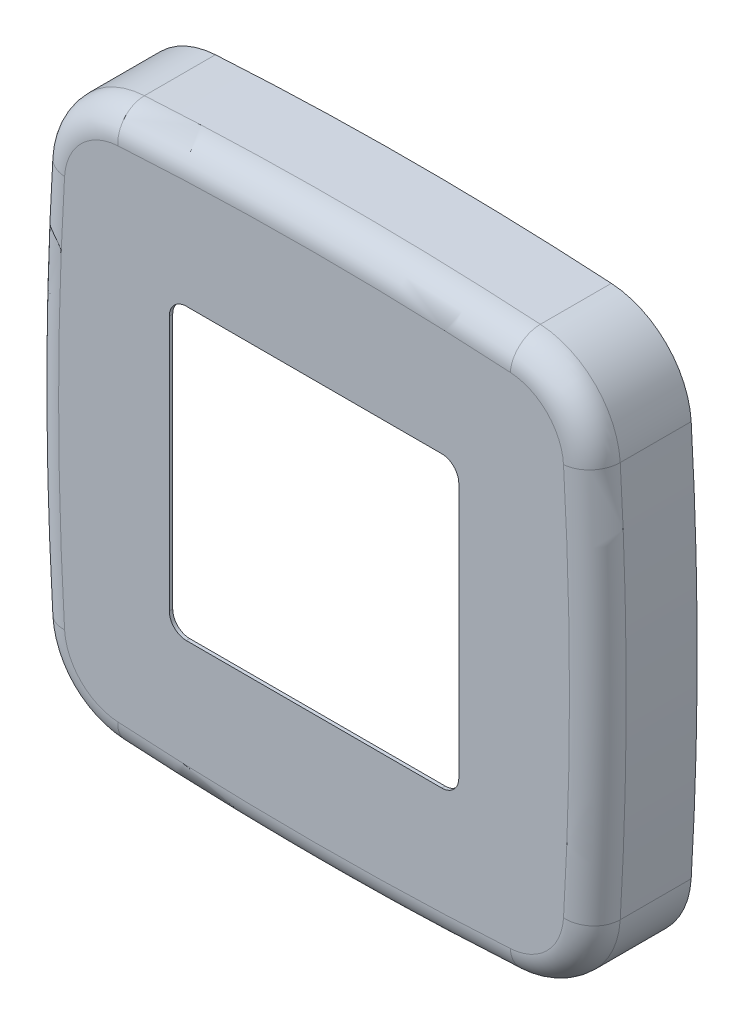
ISO-10303-21;
HEADER;
FILE_DESCRIPTION(('STEP AP214'),'2;1');
FILE_NAME('part.step','',(''),(''),'','','');
FILE_SCHEMA(('AUTOMOTIVE_DESIGN { 1 0 10303 214 1 1 1 1 }'));
ENDSEC;
DATA;
#1=APPLICATION_CONTEXT('core data for automotive mechanical design processes');
#2=APPLICATION_PROTOCOL_DEFINITION('international standard','automotive_design',2000,#1);
#3=PRODUCT_CONTEXT('',#1,'mechanical');
#4=PRODUCT('Part','Part','',(#3));
#5=PRODUCT_RELATED_PRODUCT_CATEGORY('part','',(#4));
#6=PRODUCT_DEFINITION_FORMATION('','',#4);
#7=PRODUCT_DEFINITION_CONTEXT('part definition',#1,'design');
#8=PRODUCT_DEFINITION('design','',#6,#7);
#9=PRODUCT_DEFINITION_SHAPE('','',#8);
#10=(LENGTH_UNIT() NAMED_UNIT(*) SI_UNIT(.MILLI.,.METRE.));
#11=(NAMED_UNIT(*) PLANE_ANGLE_UNIT() SI_UNIT($,.RADIAN.));
#12=(NAMED_UNIT(*) SI_UNIT($,.STERADIAN.) SOLID_ANGLE_UNIT());
#13=UNCERTAINTY_MEASURE_WITH_UNIT(LENGTH_MEASURE(1.E-05),#10,'distance_accuracy_value','');
#14=(GEOMETRIC_REPRESENTATION_CONTEXT(3) GLOBAL_UNCERTAINTY_ASSIGNED_CONTEXT((#13)) GLOBAL_UNIT_ASSIGNED_CONTEXT((#10,
#11,#12)) REPRESENTATION_CONTEXT('',''));
#15=CARTESIAN_POINT('',(0.,0.,0.));
#16=DIRECTION('',(0.,0.,1.));
#17=DIRECTION('',(1.,0.,0.));
#18=AXIS2_PLACEMENT_3D('',#15,#16,#17);
#19=CARTESIAN_POINT('',(25.5,-25.5,-133.75));
#20=DIRECTION('',(0.,1.,0.));
#21=DIRECTION('',(-1.,0.,0.));
#22=AXIS2_PLACEMENT_3D('',#19,#20,#21);
#23=PLANE('',#22);
#24=DIRECTION('',(0.,0.,1.));
#25=VECTOR('',#24,1.);
#26=CARTESIAN_POINT('',(22.5,-25.5,-8.75));
#27=LINE('',#26,#25);
#28=CARTESIAN_POINT('',(22.5,-25.5,8.75));
#29=VERTEX_POINT('',#28);
#30=CARTESIAN_POINT('',(22.5,-25.5,8.15));
#31=VERTEX_POINT('',#30);
#32=EDGE_CURVE('E479',#29,#31,#27,.F.);
#33=ORIENTED_EDGE('',*,*,#32,.T.);
#34=DIRECTION('',(-1.,0.,0.));
#35=VECTOR('',#34,1.);
#36=CARTESIAN_POINT('',(0.,-25.5,8.15));
#37=LINE('',#36,#35);
#38=CARTESIAN_POINT('',(-22.5,-25.5,8.15));
#39=VERTEX_POINT('',#38);
#40=EDGE_CURVE('E327',#31,#39,#37,.T.);
#41=ORIENTED_EDGE('',*,*,#40,.T.);
#42=DIRECTION('',(0.,0.,1.));
#43=VECTOR('',#42,1.);
#44=CARTESIAN_POINT('',(-22.5,-25.5,8.75));
#45=LINE('',#44,#43);
#46=CARTESIAN_POINT('',(-22.5,-25.5,8.75));
#47=VERTEX_POINT('',#46);
#48=EDGE_CURVE('E484',#39,#47,#45,.T.);
#49=ORIENTED_EDGE('',*,*,#48,.T.);
#50=DIRECTION('',(-1.,0.,0.));
#51=VECTOR('',#50,1.);
#52=CARTESIAN_POINT('',(25.5,-25.5,8.75));
#53=LINE('',#52,#51);
#54=EDGE_CURVE('E346',#29,#47,#53,.T.);
#55=ORIENTED_EDGE('',*,*,#54,.F.);
#56=EDGE_LOOP('',(#33,#41,#49,#55));
#57=FACE_BOUND('',#56,.T.);
#58=ADVANCED_FACE('F15',(#57),#23,.T.);
#59=CARTESIAN_POINT('',(-25.5,-25.5,-133.75));
#60=DIRECTION('',(1.,0.,0.));
#61=DIRECTION('',(0.,0.,-1.));
#62=AXIS2_PLACEMENT_3D('',#59,#60,#61);
#63=PLANE('',#62);
#64=DIRECTION('',(0.,0.,1.));
#65=VECTOR('',#64,1.);
#66=CARTESIAN_POINT('',(-25.5,-22.5,-8.75));
#67=LINE('',#66,#65);
#68=CARTESIAN_POINT('',(-25.5,-22.5,8.75));
#69=VERTEX_POINT('',#68);
#70=CARTESIAN_POINT('',(-25.5,-22.5,8.15));
#71=VERTEX_POINT('',#70);
#72=EDGE_CURVE('E486',#69,#71,#67,.F.);
#73=ORIENTED_EDGE('',*,*,#72,.T.);
#74=DIRECTION('',(0.,1.,0.));
#75=VECTOR('',#74,1.);
#76=CARTESIAN_POINT('',(-25.5,0.,8.15));
#77=LINE('',#76,#75);
#78=CARTESIAN_POINT('',(-25.5,22.5,8.15));
#79=VERTEX_POINT('',#78);
#80=EDGE_CURVE('E323',#71,#79,#77,.T.);
#81=ORIENTED_EDGE('',*,*,#80,.T.);
#82=DIRECTION('',(0.,0.,1.));
#83=VECTOR('',#82,1.);
#84=CARTESIAN_POINT('',(-25.5,22.5,8.75));
#85=LINE('',#84,#83);
#86=CARTESIAN_POINT('',(-25.5,22.5,8.75));
#87=VERTEX_POINT('',#86);
#88=EDGE_CURVE('E491',#79,#87,#85,.T.);
#89=ORIENTED_EDGE('',*,*,#88,.T.);
#90=DIRECTION('',(0.,1.,0.));
#91=VECTOR('',#90,1.);
#92=CARTESIAN_POINT('',(-25.5,-25.5,8.75));
#93=LINE('',#92,#91);
#94=EDGE_CURVE('E359',#69,#87,#93,.T.);
#95=ORIENTED_EDGE('',*,*,#94,.F.);
#96=EDGE_LOOP('',(#73,#81,#89,#95));
#97=FACE_BOUND('',#96,.T.);
#98=ADVANCED_FACE('F502',(#97),#63,.T.);
#99=CARTESIAN_POINT('',(-25.5,25.5,-133.75));
#100=DIRECTION('',(0.,-1.,0.));
#101=DIRECTION('',(0.,0.,-1.));
#102=AXIS2_PLACEMENT_3D('',#99,#100,#101);
#103=PLANE('',#102);
#104=DIRECTION('',(0.,0.,1.));
#105=VECTOR('',#104,1.);
#106=CARTESIAN_POINT('',(-22.5,25.5,-8.75));
#107=LINE('',#106,#105);
#108=CARTESIAN_POINT('',(-22.5,25.5,8.75));
#109=VERTEX_POINT('',#108);
#110=CARTESIAN_POINT('',(-22.5,25.5,8.15));
#111=VERTEX_POINT('',#110);
#112=EDGE_CURVE('E23',#109,#111,#107,.F.);
#113=ORIENTED_EDGE('',*,*,#112,.T.);
#114=DIRECTION('',(1.,0.,0.));
#115=VECTOR('',#114,1.);
#116=CARTESIAN_POINT('',(0.,25.5,8.15));
#117=LINE('',#116,#115);
#118=CARTESIAN_POINT('',(22.5,25.5,8.15));
#119=VERTEX_POINT('',#118);
#120=EDGE_CURVE('E38',#111,#119,#117,.T.);
#121=ORIENTED_EDGE('',*,*,#120,.T.);
#122=DIRECTION('',(0.,0.,1.));
#123=VECTOR('',#122,1.);
#124=CARTESIAN_POINT('',(22.5,25.5,8.75));
#125=LINE('',#124,#123);
#126=CARTESIAN_POINT('',(22.5,25.5,8.75));
#127=VERTEX_POINT('',#126);
#128=EDGE_CURVE('E450',#119,#127,#125,.T.);
#129=ORIENTED_EDGE('',*,*,#128,.T.);
#130=DIRECTION('',(1.,0.,0.));
#131=VECTOR('',#130,1.);
#132=CARTESIAN_POINT('',(-25.5,25.5,8.75));
#133=LINE('',#132,#131);
#134=EDGE_CURVE('E363',#109,#127,#133,.T.);
#135=ORIENTED_EDGE('',*,*,#134,.F.);
#136=EDGE_LOOP('',(#113,#121,#129,#135));
#137=FACE_BOUND('',#136,.T.);
#138=ADVANCED_FACE('F496',(#137),#103,.T.);
#139=CARTESIAN_POINT('',(25.5,25.5,-133.75));
#140=DIRECTION('',(-1.,0.,0.));
#141=DIRECTION('',(0.,0.,1.));
#142=AXIS2_PLACEMENT_3D('',#139,#140,#141);
#143=PLANE('',#142);
#144=DIRECTION('',(0.,0.,1.));
#145=VECTOR('',#144,1.);
#146=CARTESIAN_POINT('',(25.5,22.5,-8.75));
#147=LINE('',#146,#145);
#148=CARTESIAN_POINT('',(25.5,22.5,8.75));
#149=VERTEX_POINT('',#148);
#150=CARTESIAN_POINT('',(25.5,22.5,8.15));
#151=VERTEX_POINT('',#150);
#152=EDGE_CURVE('E472',#149,#151,#147,.F.);
#153=ORIENTED_EDGE('',*,*,#152,.T.);
#154=DIRECTION('',(0.,-1.,0.));
#155=VECTOR('',#154,1.);
#156=CARTESIAN_POINT('',(25.5,0.,8.15));
#157=LINE('',#156,#155);
#158=CARTESIAN_POINT('',(25.5,-22.5,8.15));
#159=VERTEX_POINT('',#158);
#160=EDGE_CURVE('E318',#151,#159,#157,.T.);
#161=ORIENTED_EDGE('',*,*,#160,.T.);
#162=DIRECTION('',(0.,0.,1.));
#163=VECTOR('',#162,1.);
#164=CARTESIAN_POINT('',(25.5,-22.5,8.75));
#165=LINE('',#164,#163);
#166=CARTESIAN_POINT('',(25.5,-22.5,8.75));
#167=VERTEX_POINT('',#166);
#168=EDGE_CURVE('E477',#159,#167,#165,.T.);
#169=ORIENTED_EDGE('',*,*,#168,.T.);
#170=DIRECTION('',(0.,-1.,0.));
#171=VECTOR('',#170,1.);
#172=CARTESIAN_POINT('',(25.5,25.5,8.75));
#173=LINE('',#172,#171);
#174=EDGE_CURVE('E367',#149,#167,#173,.T.);
#175=ORIENTED_EDGE('',*,*,#174,.F.);
#176=EDGE_LOOP('',(#153,#161,#169,#175));
#177=FACE_BOUND('',#176,.T.);
#178=ADVANCED_FACE('F517',(#177),#143,.T.);
#179=CARTESIAN_POINT('',(0.,0.,8.75));
#180=DIRECTION('',(0.,0.,1.));
#181=DIRECTION('',(1.,0.,0.));
#182=AXIS2_PLACEMENT_3D('',#179,#180,#181);
#183=PLANE('',#182);
#184=CARTESIAN_POINT('',(-33.9722676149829,-33.972267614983,8.75));
#185=DIRECTION('',(0.,0.,1.));
#186=DIRECTION('',(1.,0.,0.));
#187=AXIS2_PLACEMENT_3D('',#184,#185,#186);
#188=CIRCLE('',#187,10.);
#189=CARTESIAN_POINT('',(-43.9539805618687,-34.5767563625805,8.75));
#190=VERTEX_POINT('',#189);
#191=CARTESIAN_POINT('',(-34.5767563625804,-43.9539805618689,8.75));
#192=VERTEX_POINT('',#191);
#193=EDGE_CURVE('E428',#190,#192,#188,.T.);
#194=ORIENTED_EDGE('',*,*,#193,.T.);
#195=CARTESIAN_POINT('',(0.,527.,8.75));
#196=DIRECTION('',(0.,0.,1.));
#197=DIRECTION('',(1.,0.,0.));
#198=AXIS2_PLACEMENT_3D('',#195,#196,#197);
#199=CIRCLE('',#198,572.);
#200=CARTESIAN_POINT('',(34.5767563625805,-43.9539805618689,8.75));
#201=VERTEX_POINT('',#200);
#202=EDGE_CURVE('E430',#192,#201,#199,.T.);
#203=ORIENTED_EDGE('',*,*,#202,.T.);
#204=CARTESIAN_POINT('',(33.972267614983,-33.972267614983,8.75));
#205=DIRECTION('',(0.,0.,1.));
#206=DIRECTION('',(1.,0.,0.));
#207=AXIS2_PLACEMENT_3D('',#204,#205,#206);
#208=CIRCLE('',#207,10.);
#209=CARTESIAN_POINT('',(43.9539805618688,-34.5767563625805,8.75));
#210=VERTEX_POINT('',#209);
#211=EDGE_CURVE('E426',#201,#210,#208,.T.);
#212=ORIENTED_EDGE('',*,*,#211,.T.);
#213=CARTESIAN_POINT('',(-527.,0.,8.75));
#214=DIRECTION('',(0.,0.,1.));
#215=DIRECTION('',(1.,0.,0.));
#216=AXIS2_PLACEMENT_3D('',#213,#214,#215);
#217=CIRCLE('',#216,572.);
#218=CARTESIAN_POINT('',(43.9539805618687,34.5767563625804,8.75));
#219=VERTEX_POINT('',#218);
#220=EDGE_CURVE('E422',#210,#219,#217,.T.);
#221=ORIENTED_EDGE('',*,*,#220,.T.);
#222=CARTESIAN_POINT('',(33.9722676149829,33.9722676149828,8.75));
#223=DIRECTION('',(0.,0.,1.));
#224=DIRECTION('',(1.,0.,0.));
#225=AXIS2_PLACEMENT_3D('',#222,#223,#224);
#226=CIRCLE('',#225,10.);
#227=CARTESIAN_POINT('',(34.5767563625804,43.9539805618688,8.75));
#228=VERTEX_POINT('',#227);
#229=EDGE_CURVE('E418',#219,#228,#226,.T.);
#230=ORIENTED_EDGE('',*,*,#229,.T.);
#231=CARTESIAN_POINT('',(0.,-527.,8.75));
#232=DIRECTION('',(0.,0.,1.));
#233=DIRECTION('',(1.,0.,0.));
#234=AXIS2_PLACEMENT_3D('',#231,#232,#233);
#235=CIRCLE('',#234,572.);
#236=CARTESIAN_POINT('',(-34.5767563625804,43.9539805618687,8.75));
#237=VERTEX_POINT('',#236);
#238=EDGE_CURVE('E416',#228,#237,#235,.T.);
#239=ORIENTED_EDGE('',*,*,#238,.T.);
#240=CARTESIAN_POINT('',(-33.9722676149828,33.9722676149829,8.75));
#241=DIRECTION('',(0.,0.,1.));
#242=DIRECTION('',(1.,0.,0.));
#243=AXIS2_PLACEMENT_3D('',#240,#241,#242);
#244=CIRCLE('',#243,10.);
#245=CARTESIAN_POINT('',(-43.9539805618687,34.5767563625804,8.75));
#246=VERTEX_POINT('',#245);
#247=EDGE_CURVE('E420',#237,#246,#244,.T.);
#248=ORIENTED_EDGE('',*,*,#247,.T.);
#249=CARTESIAN_POINT('',(527.,0.,8.75));
#250=DIRECTION('',(0.,0.,1.));
#251=DIRECTION('',(1.,0.,0.));
#252=AXIS2_PLACEMENT_3D('',#249,#250,#251);
#253=CIRCLE('',#252,572.);
#254=EDGE_CURVE('E424',#246,#190,#253,.T.);
#255=ORIENTED_EDGE('',*,*,#254,.T.);
#256=EDGE_LOOP('',(#194,#203,#212,#221,#230,#239,#248,#255));
#257=FACE_BOUND('',#256,.T.);
#258=ORIENTED_EDGE('',*,*,#94,.T.);
#259=CARTESIAN_POINT('',(-22.5,22.5,8.75));
#260=DIRECTION('',(0.,0.,1.));
#261=DIRECTION('',(1.,0.,0.));
#262=AXIS2_PLACEMENT_3D('',#259,#260,#261);
#263=CIRCLE('',#262,3.);
#264=EDGE_CURVE('E10',#87,#109,#263,.F.);
#265=ORIENTED_EDGE('',*,*,#264,.T.);
#266=ORIENTED_EDGE('',*,*,#134,.T.);
#267=CARTESIAN_POINT('',(22.5,22.5,8.75));
#268=DIRECTION('',(0.,0.,1.));
#269=DIRECTION('',(1.,0.,0.));
#270=AXIS2_PLACEMENT_3D('',#267,#268,#269);
#271=CIRCLE('',#270,3.);
#272=EDGE_CURVE('E475',#127,#149,#271,.F.);
#273=ORIENTED_EDGE('',*,*,#272,.T.);
#274=ORIENTED_EDGE('',*,*,#174,.T.);
#275=CARTESIAN_POINT('',(22.5,-22.5,8.75));
#276=DIRECTION('',(0.,0.,1.));
#277=DIRECTION('',(1.,0.,0.));
#278=AXIS2_PLACEMENT_3D('',#275,#276,#277);
#279=CIRCLE('',#278,3.);
#280=EDGE_CURVE('E482',#167,#29,#279,.F.);
#281=ORIENTED_EDGE('',*,*,#280,.T.);
#282=ORIENTED_EDGE('',*,*,#54,.T.);
#283=CARTESIAN_POINT('',(-22.5,-22.5,8.75));
#284=DIRECTION('',(0.,0.,1.));
#285=DIRECTION('',(1.,0.,0.));
#286=AXIS2_PLACEMENT_3D('',#283,#284,#285);
#287=CIRCLE('',#286,3.);
#288=EDGE_CURVE('E489',#47,#69,#287,.F.);
#289=ORIENTED_EDGE('',*,*,#288,.T.);
#290=EDGE_LOOP('',(#258,#265,#266,#273,#274,#281,#282,#289));
#291=FACE_BOUND('',#290,.T.);
#292=ADVANCED_FACE('F524',(#257,#291),#183,.T.);
#293=CARTESIAN_POINT('',(0.,0.,-8.75));
#294=DIRECTION('',(0.,0.,1.));
#295=DIRECTION('',(1.,0.,0.));
#296=AXIS2_PLACEMENT_3D('',#293,#294,#295);
#297=PLANE('',#296);
#298=CARTESIAN_POINT('',(-33.9722676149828,33.9722676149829,-8.75));
#299=DIRECTION('',(0.,0.,1.));
#300=DIRECTION('',(1.,0.,0.));
#301=AXIS2_PLACEMENT_3D('',#298,#299,#300);
#302=CIRCLE('',#301,14.4);
#303=CARTESIAN_POINT('',(-48.3459342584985,34.8427314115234,-8.75));
#304=VERTEX_POINT('',#303);
#305=CARTESIAN_POINT('',(-34.8427314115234,48.3459342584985,-8.75));
#306=VERTEX_POINT('',#305);
#307=EDGE_CURVE('E264',#304,#306,#302,.F.);
#308=ORIENTED_EDGE('',*,*,#307,.F.);
#309=CARTESIAN_POINT('',(527.,0.,-8.75));
#310=DIRECTION('',(0.,0.,1.));
#311=DIRECTION('',(1.,0.,0.));
#312=AXIS2_PLACEMENT_3D('',#309,#310,#311);
#313=CIRCLE('',#312,576.4);
#314=CARTESIAN_POINT('',(-48.3459342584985,-34.8427314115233,-8.75));
#315=VERTEX_POINT('',#314);
#316=EDGE_CURVE('E292',#304,#315,#313,.T.);
#317=ORIENTED_EDGE('',*,*,#316,.T.);
#318=CARTESIAN_POINT('',(-33.9722676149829,-33.972267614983,-8.75));
#319=DIRECTION('',(0.,0.,1.));
#320=DIRECTION('',(1.,0.,0.));
#321=AXIS2_PLACEMENT_3D('',#318,#319,#320);
#322=CIRCLE('',#321,14.4);
#323=CARTESIAN_POINT('',(-34.8427314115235,-48.3459342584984,-8.75));
#324=VERTEX_POINT('',#323);
#325=EDGE_CURVE('E283',#324,#315,#322,.F.);
#326=ORIENTED_EDGE('',*,*,#325,.F.);
#327=CARTESIAN_POINT('',(0.,527.,-8.75));
#328=DIRECTION('',(0.,0.,1.));
#329=DIRECTION('',(1.,0.,0.));
#330=AXIS2_PLACEMENT_3D('',#327,#328,#329);
#331=CIRCLE('',#330,576.4);
#332=CARTESIAN_POINT('',(34.8427314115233,-48.3459342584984,-8.75));
#333=VERTEX_POINT('',#332);
#334=EDGE_CURVE('E30',#324,#333,#331,.T.);
#335=ORIENTED_EDGE('',*,*,#334,.T.);
#336=CARTESIAN_POINT('',(33.972267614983,-33.972267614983,-8.75));
#337=DIRECTION('',(0.,0.,1.));
#338=DIRECTION('',(1.,0.,0.));
#339=AXIS2_PLACEMENT_3D('',#336,#337,#338);
#340=CIRCLE('',#339,14.4);
#341=CARTESIAN_POINT('',(48.3459342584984,-34.8427314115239,-8.75));
#342=VERTEX_POINT('',#341);
#343=EDGE_CURVE('E298',#342,#333,#340,.F.);
#344=ORIENTED_EDGE('',*,*,#343,.F.);
#345=CARTESIAN_POINT('',(-527.,0.,-8.75));
#346=DIRECTION('',(0.,0.,1.));
#347=DIRECTION('',(1.,0.,0.));
#348=AXIS2_PLACEMENT_3D('',#345,#346,#347);
#349=CIRCLE('',#348,576.4);
#350=CARTESIAN_POINT('',(48.3459342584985,34.8427314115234,-8.75));
#351=VERTEX_POINT('',#350);
#352=EDGE_CURVE('E278',#342,#351,#349,.T.);
#353=ORIENTED_EDGE('',*,*,#352,.T.);
#354=CARTESIAN_POINT('',(33.9722676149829,33.9722676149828,-8.75));
#355=DIRECTION('',(0.,0.,1.));
#356=DIRECTION('',(1.,0.,0.));
#357=AXIS2_PLACEMENT_3D('',#354,#355,#356);
#358=CIRCLE('',#357,14.4);
#359=CARTESIAN_POINT('',(34.8427314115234,48.3459342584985,-8.75));
#360=VERTEX_POINT('',#359);
#361=EDGE_CURVE('E286',#360,#351,#358,.F.);
#362=ORIENTED_EDGE('',*,*,#361,.F.);
#363=CARTESIAN_POINT('',(0.,-527.,-8.75));
#364=DIRECTION('',(0.,0.,1.));
#365=DIRECTION('',(1.,0.,0.));
#366=AXIS2_PLACEMENT_3D('',#363,#364,#365);
#367=CIRCLE('',#366,576.4);
#368=EDGE_CURVE('E347',#360,#306,#367,.T.);
#369=ORIENTED_EDGE('',*,*,#368,.T.);
#370=EDGE_LOOP('',(#308,#317,#326,#335,#344,#353,#362,#369));
#371=FACE_BOUND('',#370,.T.);
#372=CARTESIAN_POINT('',(527.,0.,-8.75));
#373=DIRECTION('',(0.,0.,1.));
#374=DIRECTION('',(1.,0.,0.));
#375=AXIS2_PLACEMENT_3D('',#372,#373,#374);
#376=CIRCLE('',#375,577.);
#377=CARTESIAN_POINT('',(-48.9448370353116,34.8790007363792,-8.75));
#378=VERTEX_POINT('',#377);
#379=CARTESIAN_POINT('',(-48.9448370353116,-34.8790007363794,-8.75));
#380=VERTEX_POINT('',#379);
#381=EDGE_CURVE('E383',#378,#380,#376,.T.);
#382=ORIENTED_EDGE('',*,*,#381,.F.);
#383=CARTESIAN_POINT('',(-33.9722676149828,33.9722676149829,-8.75));
#384=DIRECTION('',(0.,0.,1.));
#385=DIRECTION('',(1.,0.,0.));
#386=AXIS2_PLACEMENT_3D('',#383,#384,#385);
#387=CIRCLE('',#386,15.);
#388=CARTESIAN_POINT('',(-34.8790007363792,48.9448370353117,-8.75));
#389=VERTEX_POINT('',#388);
#390=EDGE_CURVE('E414',#378,#389,#387,.F.);
#391=ORIENTED_EDGE('',*,*,#390,.T.);
#392=CARTESIAN_POINT('',(0.,-527.,-8.75));
#393=DIRECTION('',(0.,0.,1.));
#394=DIRECTION('',(1.,0.,0.));
#395=AXIS2_PLACEMENT_3D('',#392,#393,#394);
#396=CIRCLE('',#395,577.);
#397=CARTESIAN_POINT('',(34.8790007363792,48.9448370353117,-8.75));
#398=VERTEX_POINT('',#397);
#399=EDGE_CURVE('E377',#398,#389,#396,.T.);
#400=ORIENTED_EDGE('',*,*,#399,.F.);
#401=CARTESIAN_POINT('',(33.9722676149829,33.9722676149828,-8.75));
#402=DIRECTION('',(0.,0.,1.));
#403=DIRECTION('',(1.,0.,0.));
#404=AXIS2_PLACEMENT_3D('',#401,#402,#403);
#405=CIRCLE('',#404,15.);
#406=CARTESIAN_POINT('',(48.9448370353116,34.8790007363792,-8.75));
#407=VERTEX_POINT('',#406);
#408=EDGE_CURVE('E390',#398,#407,#405,.F.);
#409=ORIENTED_EDGE('',*,*,#408,.T.);
#410=CARTESIAN_POINT('',(-527.,0.,-8.75));
#411=DIRECTION('',(0.,0.,1.));
#412=DIRECTION('',(1.,0.,0.));
#413=AXIS2_PLACEMENT_3D('',#410,#411,#412);
#414=CIRCLE('',#413,577.);
#415=CARTESIAN_POINT('',(48.9448370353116,-34.8790007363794,-8.75));
#416=VERTEX_POINT('',#415);
#417=EDGE_CURVE('E375',#416,#407,#414,.T.);
#418=ORIENTED_EDGE('',*,*,#417,.F.);
#419=CARTESIAN_POINT('',(33.972267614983,-33.972267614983,-8.75));
#420=DIRECTION('',(0.,0.,1.));
#421=DIRECTION('',(1.,0.,0.));
#422=AXIS2_PLACEMENT_3D('',#419,#420,#421);
#423=CIRCLE('',#422,15.);
#424=CARTESIAN_POINT('',(34.8790007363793,-48.9448370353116,-8.75));
#425=VERTEX_POINT('',#424);
#426=EDGE_CURVE('E398',#416,#425,#423,.F.);
#427=ORIENTED_EDGE('',*,*,#426,.T.);
#428=CARTESIAN_POINT('',(0.,527.,-8.75));
#429=DIRECTION('',(0.,0.,1.));
#430=DIRECTION('',(1.,0.,0.));
#431=AXIS2_PLACEMENT_3D('',#428,#429,#430);
#432=CIRCLE('',#431,577.);
#433=CARTESIAN_POINT('',(-34.8790007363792,-48.9448370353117,-8.75));
#434=VERTEX_POINT('',#433);
#435=EDGE_CURVE('E381',#434,#425,#432,.T.);
#436=ORIENTED_EDGE('',*,*,#435,.F.);
#437=CARTESIAN_POINT('',(-33.9722676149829,-33.972267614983,-8.75));
#438=DIRECTION('',(0.,0.,1.));
#439=DIRECTION('',(1.,0.,0.));
#440=AXIS2_PLACEMENT_3D('',#437,#438,#439);
#441=CIRCLE('',#440,15.);
#442=EDGE_CURVE('E406',#434,#380,#441,.F.);
#443=ORIENTED_EDGE('',*,*,#442,.T.);
#444=EDGE_LOOP('',(#382,#391,#400,#409,#418,#427,#436,#443));
#445=FACE_BOUND('',#444,.T.);
#446=ADVANCED_FACE('F526',(#371,#445),#297,.F.);
#447=CARTESIAN_POINT('',(0.,527.,-133.75));
#448=DIRECTION('',(0.,0.,1.));
#449=DIRECTION('',(1.,0.,0.));
#450=AXIS2_PLACEMENT_3D('',#447,#448,#449);
#451=CYLINDRICAL_SURFACE('',#450,577.);
#452=DIRECTION('',(0.,0.,1.));
#453=VECTOR('',#452,1.);
#454=CARTESIAN_POINT('',(34.8790007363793,-48.9448370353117,-133.75));
#455=LINE('',#454,#453);
#456=CARTESIAN_POINT('',(34.8790007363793,-48.9448370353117,3.75));
#457=VERTEX_POINT('',#456);
#458=EDGE_CURVE('E393',#425,#457,#455,.T.);
#459=ORIENTED_EDGE('',*,*,#458,.T.);
#460=CARTESIAN_POINT('',(0.,527.,3.75));
#461=DIRECTION('',(0.,0.,1.));
#462=DIRECTION('',(1.,0.,0.));
#463=AXIS2_PLACEMENT_3D('',#460,#461,#462);
#464=CIRCLE('',#463,577.);
#465=CARTESIAN_POINT('',(-34.8790007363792,-48.9448370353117,3.75));
#466=VERTEX_POINT('',#465);
#467=EDGE_CURVE('E433',#457,#466,#464,.F.);
#468=ORIENTED_EDGE('',*,*,#467,.T.);
#469=DIRECTION('',(0.,0.,1.));
#470=VECTOR('',#469,1.);
#471=CARTESIAN_POINT('',(-34.8790007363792,-48.9448370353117,-133.75));
#472=LINE('',#471,#470);
#473=EDGE_CURVE('E404',#466,#434,#472,.F.);
#474=ORIENTED_EDGE('',*,*,#473,.T.);
#475=ORIENTED_EDGE('',*,*,#435,.T.);
#476=EDGE_LOOP('',(#459,#468,#474,#475));
#477=FACE_BOUND('',#476,.T.);
#478=ADVANCED_FACE('F534',(#477),#451,.T.);
#479=CARTESIAN_POINT('',(527.,0.,-133.75));
#480=DIRECTION('',(0.,0.,1.));
#481=DIRECTION('',(1.,0.,0.));
#482=AXIS2_PLACEMENT_3D('',#479,#480,#481);
#483=CYLINDRICAL_SURFACE('',#482,577.);
#484=DIRECTION('',(0.,0.,1.));
#485=VECTOR('',#484,1.);
#486=CARTESIAN_POINT('',(-48.9448370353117,-34.8790007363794,-133.75));
#487=LINE('',#486,#485);
#488=CARTESIAN_POINT('',(-48.9448370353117,-34.8790007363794,3.75));
#489=VERTEX_POINT('',#488);
#490=EDGE_CURVE('E401',#380,#489,#487,.T.);
#491=ORIENTED_EDGE('',*,*,#490,.T.);
#492=CARTESIAN_POINT('',(527.,0.,3.75));
#493=DIRECTION('',(0.,0.,1.));
#494=DIRECTION('',(1.,0.,0.));
#495=AXIS2_PLACEMENT_3D('',#492,#493,#494);
#496=CIRCLE('',#495,577.);
#497=CARTESIAN_POINT('',(-48.9448370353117,34.8790007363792,3.75));
#498=VERTEX_POINT('',#497);
#499=EDGE_CURVE('E440',#489,#498,#496,.F.);
#500=ORIENTED_EDGE('',*,*,#499,.T.);
#501=DIRECTION('',(0.,0.,1.));
#502=VECTOR('',#501,1.);
#503=CARTESIAN_POINT('',(-48.9448370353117,34.8790007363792,-133.75));
#504=LINE('',#503,#502);
#505=EDGE_CURVE('E412',#498,#378,#504,.F.);
#506=ORIENTED_EDGE('',*,*,#505,.T.);
#507=ORIENTED_EDGE('',*,*,#381,.T.);
#508=EDGE_LOOP('',(#491,#500,#506,#507));
#509=FACE_BOUND('',#508,.T.);
#510=ADVANCED_FACE('F549',(#509),#483,.T.);
#511=CARTESIAN_POINT('',(0.,-527.,-133.75));
#512=DIRECTION('',(0.,0.,1.));
#513=DIRECTION('',(1.,0.,0.));
#514=AXIS2_PLACEMENT_3D('',#511,#512,#513);
#515=CYLINDRICAL_SURFACE('',#514,577.);
#516=DIRECTION('',(0.,0.,1.));
#517=VECTOR('',#516,1.);
#518=CARTESIAN_POINT('',(-34.8790007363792,48.9448370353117,-133.75));
#519=LINE('',#518,#517);
#520=CARTESIAN_POINT('',(-34.8790007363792,48.9448370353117,3.75));
#521=VERTEX_POINT('',#520);
#522=EDGE_CURVE('E409',#389,#521,#519,.T.);
#523=ORIENTED_EDGE('',*,*,#522,.T.);
#524=CARTESIAN_POINT('',(0.,-527.,3.75));
#525=DIRECTION('',(0.,0.,1.));
#526=DIRECTION('',(1.,0.,0.));
#527=AXIS2_PLACEMENT_3D('',#524,#525,#526);
#528=CIRCLE('',#527,577.);
#529=CARTESIAN_POINT('',(34.8790007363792,48.9448370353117,3.75));
#530=VERTEX_POINT('',#529);
#531=EDGE_CURVE('E448',#521,#530,#528,.F.);
#532=ORIENTED_EDGE('',*,*,#531,.T.);
#533=DIRECTION('',(0.,0.,1.));
#534=VECTOR('',#533,1.);
#535=CARTESIAN_POINT('',(34.8790007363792,48.9448370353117,-133.75));
#536=LINE('',#535,#534);
#537=EDGE_CURVE('E388',#530,#398,#536,.F.);
#538=ORIENTED_EDGE('',*,*,#537,.T.);
#539=ORIENTED_EDGE('',*,*,#399,.T.);
#540=EDGE_LOOP('',(#523,#532,#538,#539));
#541=FACE_BOUND('',#540,.T.);
#542=ADVANCED_FACE('F555',(#541),#515,.T.);
#543=CARTESIAN_POINT('',(-527.,0.,-133.75));
#544=DIRECTION('',(0.,0.,1.));
#545=DIRECTION('',(1.,0.,0.));
#546=AXIS2_PLACEMENT_3D('',#543,#544,#545);
#547=CYLINDRICAL_SURFACE('',#546,577.);
#548=DIRECTION('',(0.,0.,1.));
#549=VECTOR('',#548,1.);
#550=CARTESIAN_POINT('',(48.9448370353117,34.8790007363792,-133.75));
#551=LINE('',#550,#549);
#552=CARTESIAN_POINT('',(48.9448370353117,34.8790007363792,3.75));
#553=VERTEX_POINT('',#552);
#554=EDGE_CURVE('E385',#407,#553,#551,.T.);
#555=ORIENTED_EDGE('',*,*,#554,.T.);
#556=CARTESIAN_POINT('',(-527.,0.,3.75));
#557=DIRECTION('',(0.,0.,1.));
#558=DIRECTION('',(1.,0.,0.));
#559=AXIS2_PLACEMENT_3D('',#556,#557,#558);
#560=CIRCLE('',#559,577.);
#561=CARTESIAN_POINT('',(48.9448370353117,-34.8790007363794,3.75));
#562=VERTEX_POINT('',#561);
#563=EDGE_CURVE('E442',#553,#562,#560,.F.);
#564=ORIENTED_EDGE('',*,*,#563,.T.);
#565=DIRECTION('',(0.,0.,1.));
#566=VECTOR('',#565,1.);
#567=CARTESIAN_POINT('',(48.9448370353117,-34.8790007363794,-133.75));
#568=LINE('',#567,#566);
#569=EDGE_CURVE('E396',#562,#416,#568,.F.);
#570=ORIENTED_EDGE('',*,*,#569,.T.);
#571=ORIENTED_EDGE('',*,*,#417,.T.);
#572=EDGE_LOOP('',(#555,#564,#570,#571));
#573=FACE_BOUND('',#572,.T.);
#574=ADVANCED_FACE('F551',(#573),#547,.T.);
#575=CARTESIAN_POINT('',(33.9722676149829,33.9722676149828,-133.75));
#576=DIRECTION('',(0.,0.,1.));
#577=DIRECTION('',(1.,0.,0.));
#578=AXIS2_PLACEMENT_3D('',#575,#576,#577);
#579=CYLINDRICAL_SURFACE('',#578,15.);
#580=ORIENTED_EDGE('',*,*,#537,.F.);
#581=CARTESIAN_POINT('',(33.9722676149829,33.9722676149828,3.75));
#582=DIRECTION('',(0.,0.,1.));
#583=DIRECTION('',(1.,0.,0.));
#584=AXIS2_PLACEMENT_3D('',#581,#582,#583);
#585=CIRCLE('',#584,15.);
#586=EDGE_CURVE('E446',#530,#553,#585,.F.);
#587=ORIENTED_EDGE('',*,*,#586,.T.);
#588=ORIENTED_EDGE('',*,*,#554,.F.);
#589=ORIENTED_EDGE('',*,*,#408,.F.);
#590=EDGE_LOOP('',(#580,#587,#588,#589));
#591=FACE_BOUND('',#590,.T.);
#592=ADVANCED_FACE('F554',(#591),#579,.T.);
#593=CARTESIAN_POINT('',(33.972267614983,-33.972267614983,-133.75));
#594=DIRECTION('',(0.,0.,1.));
#595=DIRECTION('',(1.,0.,0.));
#596=AXIS2_PLACEMENT_3D('',#593,#594,#595);
#597=CYLINDRICAL_SURFACE('',#596,15.);
#598=ORIENTED_EDGE('',*,*,#569,.F.);
#599=CARTESIAN_POINT('',(33.972267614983,-33.972267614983,3.75));
#600=DIRECTION('',(0.,0.,1.));
#601=DIRECTION('',(1.,0.,0.));
#602=AXIS2_PLACEMENT_3D('',#599,#600,#601);
#603=CIRCLE('',#602,15.);
#604=EDGE_CURVE('E438',#562,#457,#603,.F.);
#605=ORIENTED_EDGE('',*,*,#604,.T.);
#606=ORIENTED_EDGE('',*,*,#458,.F.);
#607=ORIENTED_EDGE('',*,*,#426,.F.);
#608=EDGE_LOOP('',(#598,#605,#606,#607));
#609=FACE_BOUND('',#608,.T.);
#610=ADVANCED_FACE('F778',(#609),#597,.T.);
#611=CARTESIAN_POINT('',(-33.9722676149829,-33.972267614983,-133.75));
#612=DIRECTION('',(0.,0.,1.));
#613=DIRECTION('',(1.,0.,0.));
#614=AXIS2_PLACEMENT_3D('',#611,#612,#613);
#615=CYLINDRICAL_SURFACE('',#614,15.);
#616=ORIENTED_EDGE('',*,*,#473,.F.);
#617=CARTESIAN_POINT('',(-33.9722676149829,-33.972267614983,3.75));
#618=DIRECTION('',(0.,0.,1.));
#619=DIRECTION('',(1.,0.,0.));
#620=AXIS2_PLACEMENT_3D('',#617,#618,#619);
#621=CIRCLE('',#620,15.);
#622=EDGE_CURVE('E436',#466,#489,#621,.F.);
#623=ORIENTED_EDGE('',*,*,#622,.T.);
#624=ORIENTED_EDGE('',*,*,#490,.F.);
#625=ORIENTED_EDGE('',*,*,#442,.F.);
#626=EDGE_LOOP('',(#616,#623,#624,#625));
#627=FACE_BOUND('',#626,.T.);
#628=ADVANCED_FACE('F611',(#627),#615,.T.);
#629=CARTESIAN_POINT('',(-33.9722676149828,33.9722676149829,-133.75));
#630=DIRECTION('',(0.,0.,1.));
#631=DIRECTION('',(1.,0.,0.));
#632=AXIS2_PLACEMENT_3D('',#629,#630,#631);
#633=CYLINDRICAL_SURFACE('',#632,15.);
#634=ORIENTED_EDGE('',*,*,#505,.F.);
#635=CARTESIAN_POINT('',(-33.9722676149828,33.9722676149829,3.75));
#636=DIRECTION('',(0.,0.,1.));
#637=DIRECTION('',(1.,0.,0.));
#638=AXIS2_PLACEMENT_3D('',#635,#636,#637);
#639=CIRCLE('',#638,15.);
#640=EDGE_CURVE('E444',#498,#521,#639,.F.);
#641=ORIENTED_EDGE('',*,*,#640,.T.);
#642=ORIENTED_EDGE('',*,*,#522,.F.);
#643=ORIENTED_EDGE('',*,*,#390,.F.);
#644=EDGE_LOOP('',(#634,#641,#642,#643));
#645=FACE_BOUND('',#644,.T.);
#646=ADVANCED_FACE('F588',(#645),#633,.T.);
#647=CARTESIAN_POINT('',(0.,-527.,3.75));
#648=DIRECTION('',(0.,0.,1.));
#649=DIRECTION('',(1.,0.,0.));
#650=AXIS2_PLACEMENT_3D('',#647,#648,#649);
#651=TOROIDAL_SURFACE('',#650,572.,5.);
#652=CARTESIAN_POINT('',(34.5767563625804,43.9539805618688,3.75));
#653=DIRECTION('',(0.998171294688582,-0.0604488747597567,0.));
#654=DIRECTION('',(0.0604488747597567,0.998171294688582,0.));
#655=AXIS2_PLACEMENT_3D('',#652,#653,#654);
#656=CIRCLE('',#655,5.);
#657=EDGE_CURVE('E466',#530,#228,#656,.T.);
#658=ORIENTED_EDGE('',*,*,#657,.F.);
#659=ORIENTED_EDGE('',*,*,#531,.F.);
#660=CARTESIAN_POINT('',(-34.5767563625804,43.9539805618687,3.75));
#661=DIRECTION('',(-0.998171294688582,-0.0604488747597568,0.));
#662=DIRECTION('',(0.0604488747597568,-0.998171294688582,0.));
#663=AXIS2_PLACEMENT_3D('',#660,#661,#662);
#664=CIRCLE('',#663,5.);
#665=EDGE_CURVE('E378',#237,#521,#664,.T.);
#666=ORIENTED_EDGE('',*,*,#665,.F.);
#667=ORIENTED_EDGE('',*,*,#238,.F.);
#668=EDGE_LOOP('',(#658,#659,#666,#667));
#669=FACE_BOUND('',#668,.T.);
#670=ADVANCED_FACE('F595',(#669),#651,.T.);
#671=CARTESIAN_POINT('',(-33.9722676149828,33.9722676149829,3.75));
#672=DIRECTION('',(0.,0.,1.));
#673=DIRECTION('',(1.,0.,0.));
#674=AXIS2_PLACEMENT_3D('',#671,#672,#673);
#675=TOROIDAL_SURFACE('',#674,10.,5.);
#676=ORIENTED_EDGE('',*,*,#665,.T.);
#677=ORIENTED_EDGE('',*,*,#640,.F.);
#678=CARTESIAN_POINT('',(-43.9539805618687,34.5767563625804,3.75));
#679=DIRECTION('',(-0.0604488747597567,-0.998171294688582,0.));
#680=DIRECTION('',(0.998171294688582,-0.0604488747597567,0.));
#681=AXIS2_PLACEMENT_3D('',#678,#679,#680);
#682=CIRCLE('',#681,5.);
#683=EDGE_CURVE('E463',#246,#498,#682,.T.);
#684=ORIENTED_EDGE('',*,*,#683,.F.);
#685=ORIENTED_EDGE('',*,*,#247,.F.);
#686=EDGE_LOOP('',(#676,#677,#684,#685));
#687=FACE_BOUND('',#686,.T.);
#688=ADVANCED_FACE('F585',(#687),#675,.T.);
#689=CARTESIAN_POINT('',(33.9722676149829,33.9722676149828,3.75));
#690=DIRECTION('',(0.,0.,1.));
#691=DIRECTION('',(1.,0.,0.));
#692=AXIS2_PLACEMENT_3D('',#689,#690,#691);
#693=TOROIDAL_SURFACE('',#692,10.,5.);
#694=ORIENTED_EDGE('',*,*,#657,.T.);
#695=ORIENTED_EDGE('',*,*,#229,.F.);
#696=CARTESIAN_POINT('',(43.9539805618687,34.5767563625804,3.75));
#697=DIRECTION('',(0.0604488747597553,-0.998171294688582,0.));
#698=DIRECTION('',(0.998171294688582,0.0604488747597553,0.));
#699=AXIS2_PLACEMENT_3D('',#696,#697,#698);
#700=CIRCLE('',#699,5.);
#701=EDGE_CURVE('E460',#553,#219,#700,.T.);
#702=ORIENTED_EDGE('',*,*,#701,.F.);
#703=ORIENTED_EDGE('',*,*,#586,.F.);
#704=EDGE_LOOP('',(#694,#695,#702,#703));
#705=FACE_BOUND('',#704,.T.);
#706=ADVANCED_FACE('F600',(#705),#693,.T.);
#707=CARTESIAN_POINT('',(527.,0.,3.75));
#708=DIRECTION('',(0.,0.,1.));
#709=DIRECTION('',(1.,0.,0.));
#710=AXIS2_PLACEMENT_3D('',#707,#708,#709);
#711=TOROIDAL_SURFACE('',#710,572.,5.);
#712=ORIENTED_EDGE('',*,*,#683,.T.);
#713=ORIENTED_EDGE('',*,*,#499,.F.);
#714=CARTESIAN_POINT('',(-43.9539805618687,-34.5767563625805,3.75));
#715=DIRECTION('',(0.0604488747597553,-0.998171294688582,0.));
#716=DIRECTION('',(0.998171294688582,0.0604488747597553,0.));
#717=AXIS2_PLACEMENT_3D('',#714,#715,#716);
#718=CIRCLE('',#717,5.);
#719=EDGE_CURVE('E457',#190,#489,#718,.T.);
#720=ORIENTED_EDGE('',*,*,#719,.F.);
#721=ORIENTED_EDGE('',*,*,#254,.F.);
#722=EDGE_LOOP('',(#712,#713,#720,#721));
#723=FACE_BOUND('',#722,.T.);
#724=ADVANCED_FACE('F571',(#723),#711,.T.);
#725=CARTESIAN_POINT('',(-527.,0.,3.75));
#726=DIRECTION('',(0.,0.,1.));
#727=DIRECTION('',(1.,0.,0.));
#728=AXIS2_PLACEMENT_3D('',#725,#726,#727);
#729=TOROIDAL_SURFACE('',#728,572.,5.);
#730=ORIENTED_EDGE('',*,*,#701,.T.);
#731=ORIENTED_EDGE('',*,*,#220,.F.);
#732=CARTESIAN_POINT('',(43.9539805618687,-34.5767563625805,3.75));
#733=DIRECTION('',(-0.0604488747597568,-0.998171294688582,0.));
#734=DIRECTION('',(0.998171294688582,-0.0604488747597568,0.));
#735=AXIS2_PLACEMENT_3D('',#732,#733,#734);
#736=CIRCLE('',#735,5.);
#737=EDGE_CURVE('E454',#562,#210,#736,.T.);
#738=ORIENTED_EDGE('',*,*,#737,.F.);
#739=ORIENTED_EDGE('',*,*,#563,.F.);
#740=EDGE_LOOP('',(#730,#731,#738,#739));
#741=FACE_BOUND('',#740,.T.);
#742=ADVANCED_FACE('F624',(#741),#729,.T.);
#743=CARTESIAN_POINT('',(-33.9722676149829,-33.972267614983,3.75));
#744=DIRECTION('',(0.,0.,1.));
#745=DIRECTION('',(1.,0.,0.));
#746=AXIS2_PLACEMENT_3D('',#743,#744,#745);
#747=TOROIDAL_SURFACE('',#746,10.,5.);
#748=ORIENTED_EDGE('',*,*,#719,.T.);
#749=ORIENTED_EDGE('',*,*,#622,.F.);
#750=CARTESIAN_POINT('',(-34.5767563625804,-43.9539805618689,3.75));
#751=DIRECTION('',(0.998171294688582,-0.0604488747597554,0.));
#752=DIRECTION('',(0.0604488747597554,0.998171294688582,0.));
#753=AXIS2_PLACEMENT_3D('',#750,#751,#752);
#754=CIRCLE('',#753,5.);
#755=EDGE_CURVE('E452',#192,#466,#754,.T.);
#756=ORIENTED_EDGE('',*,*,#755,.F.);
#757=ORIENTED_EDGE('',*,*,#193,.F.);
#758=EDGE_LOOP('',(#748,#749,#756,#757));
#759=FACE_BOUND('',#758,.T.);
#760=ADVANCED_FACE('F577',(#759),#747,.T.);
#761=CARTESIAN_POINT('',(33.972267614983,-33.972267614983,3.75));
#762=DIRECTION('',(0.,0.,1.));
#763=DIRECTION('',(1.,0.,0.));
#764=AXIS2_PLACEMENT_3D('',#761,#762,#763);
#765=TOROIDAL_SURFACE('',#764,10.,5.);
#766=ORIENTED_EDGE('',*,*,#737,.T.);
#767=ORIENTED_EDGE('',*,*,#211,.F.);
#768=CARTESIAN_POINT('',(34.5767563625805,-43.9539805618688,3.75));
#769=DIRECTION('',(-0.998171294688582,-0.0604488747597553,0.));
#770=DIRECTION('',(0.0604488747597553,-0.998171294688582,0.));
#771=AXIS2_PLACEMENT_3D('',#768,#769,#770);
#772=CIRCLE('',#771,5.);
#773=EDGE_CURVE('E371',#457,#201,#772,.T.);
#774=ORIENTED_EDGE('',*,*,#773,.F.);
#775=ORIENTED_EDGE('',*,*,#604,.F.);
#776=EDGE_LOOP('',(#766,#767,#774,#775));
#777=FACE_BOUND('',#776,.T.);
#778=ADVANCED_FACE('F620',(#777),#765,.T.);
#779=CARTESIAN_POINT('',(0.,527.,3.75));
#780=DIRECTION('',(0.,0.,1.));
#781=DIRECTION('',(1.,0.,0.));
#782=AXIS2_PLACEMENT_3D('',#779,#780,#781);
#783=TOROIDAL_SURFACE('',#782,572.,5.);
#784=ORIENTED_EDGE('',*,*,#755,.T.);
#785=ORIENTED_EDGE('',*,*,#467,.F.);
#786=ORIENTED_EDGE('',*,*,#773,.T.);
#787=ORIENTED_EDGE('',*,*,#202,.F.);
#788=EDGE_LOOP('',(#784,#785,#786,#787));
#789=FACE_BOUND('',#788,.T.);
#790=ADVANCED_FACE('F616',(#789),#783,.T.);
#791=CARTESIAN_POINT('',(22.5,22.5,-133.75));
#792=DIRECTION('',(0.,0.,-1.));
#793=DIRECTION('',(-1.,0.,0.));
#794=AXIS2_PLACEMENT_3D('',#791,#792,#793);
#795=CYLINDRICAL_SURFACE('',#794,3.);
#796=ORIENTED_EDGE('',*,*,#128,.F.);
#797=CARTESIAN_POINT('',(22.5,22.5,8.15));
#798=DIRECTION('',(0.,0.,1.));
#799=DIRECTION('',(1.,0.,0.));
#800=AXIS2_PLACEMENT_3D('',#797,#798,#799);
#801=CIRCLE('',#800,3.);
#802=EDGE_CURVE('E274',#119,#151,#801,.F.);
#803=ORIENTED_EDGE('',*,*,#802,.T.);
#804=ORIENTED_EDGE('',*,*,#152,.F.);
#805=ORIENTED_EDGE('',*,*,#272,.F.);
#806=EDGE_LOOP('',(#796,#803,#804,#805));
#807=FACE_BOUND('',#806,.T.);
#808=ADVANCED_FACE('F522',(#807),#795,.F.);
#809=CARTESIAN_POINT('',(22.5,-22.5,-133.75));
#810=DIRECTION('',(0.,0.,-1.));
#811=DIRECTION('',(-1.,0.,0.));
#812=AXIS2_PLACEMENT_3D('',#809,#810,#811);
#813=CYLINDRICAL_SURFACE('',#812,3.);
#814=ORIENTED_EDGE('',*,*,#168,.F.);
#815=CARTESIAN_POINT('',(22.5,-22.5,8.15));
#816=DIRECTION('',(0.,0.,1.));
#817=DIRECTION('',(1.,0.,0.));
#818=AXIS2_PLACEMENT_3D('',#815,#816,#817);
#819=CIRCLE('',#818,3.);
#820=EDGE_CURVE('E332',#159,#31,#819,.F.);
#821=ORIENTED_EDGE('',*,*,#820,.T.);
#822=ORIENTED_EDGE('',*,*,#32,.F.);
#823=ORIENTED_EDGE('',*,*,#280,.F.);
#824=EDGE_LOOP('',(#814,#821,#822,#823));
#825=FACE_BOUND('',#824,.T.);
#826=ADVANCED_FACE('F515',(#825),#813,.F.);
#827=CARTESIAN_POINT('',(-22.5,-22.5,-133.75));
#828=DIRECTION('',(0.,0.,-1.));
#829=DIRECTION('',(-1.,0.,0.));
#830=AXIS2_PLACEMENT_3D('',#827,#828,#829);
#831=CYLINDRICAL_SURFACE('',#830,3.);
#832=ORIENTED_EDGE('',*,*,#48,.F.);
#833=CARTESIAN_POINT('',(-22.5,-22.5,8.15));
#834=DIRECTION('',(0.,0.,1.));
#835=DIRECTION('',(1.,0.,0.));
#836=AXIS2_PLACEMENT_3D('',#833,#834,#835);
#837=CIRCLE('',#836,3.);
#838=EDGE_CURVE('E328',#39,#71,#837,.F.);
#839=ORIENTED_EDGE('',*,*,#838,.T.);
#840=ORIENTED_EDGE('',*,*,#72,.F.);
#841=ORIENTED_EDGE('',*,*,#288,.F.);
#842=EDGE_LOOP('',(#832,#839,#840,#841));
#843=FACE_BOUND('',#842,.T.);
#844=ADVANCED_FACE('F508',(#843),#831,.F.);
#845=CARTESIAN_POINT('',(-22.5,22.5,-133.75));
#846=DIRECTION('',(0.,0.,-1.));
#847=DIRECTION('',(-1.,0.,0.));
#848=AXIS2_PLACEMENT_3D('',#845,#846,#847);
#849=CYLINDRICAL_SURFACE('',#848,3.);
#850=ORIENTED_EDGE('',*,*,#88,.F.);
#851=CARTESIAN_POINT('',(-22.5,22.5,8.15));
#852=DIRECTION('',(0.,0.,1.));
#853=DIRECTION('',(1.,0.,0.));
#854=AXIS2_PLACEMENT_3D('',#851,#852,#853);
#855=CIRCLE('',#854,3.);
#856=EDGE_CURVE('E331',#79,#111,#855,.F.);
#857=ORIENTED_EDGE('',*,*,#856,.T.);
#858=ORIENTED_EDGE('',*,*,#112,.F.);
#859=ORIENTED_EDGE('',*,*,#264,.F.);
#860=EDGE_LOOP('',(#850,#857,#858,#859));
#861=FACE_BOUND('',#860,.T.);
#862=ADVANCED_FACE('F17',(#861),#849,.F.);
#863=CARTESIAN_POINT('',(0.,0.,8.15));
#864=DIRECTION('',(0.,0.,1.));
#865=DIRECTION('',(1.,0.,0.));
#866=AXIS2_PLACEMENT_3D('',#863,#864,#865);
#867=PLANE('',#866);
#868=CARTESIAN_POINT('',(-33.9722676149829,-33.972267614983,8.15));
#869=DIRECTION('',(0.,0.,1.));
#870=DIRECTION('',(1.,0.,0.));
#871=AXIS2_PLACEMENT_3D('',#868,#869,#870);
#872=CIRCLE('',#871,10.);
#873=CARTESIAN_POINT('',(-43.9539805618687,-34.5767563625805,8.15));
#874=VERTEX_POINT('',#873);
#875=CARTESIAN_POINT('',(-34.5767563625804,-43.9539805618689,8.15));
#876=VERTEX_POINT('',#875);
#877=EDGE_CURVE('E225',#874,#876,#872,.T.);
#878=ORIENTED_EDGE('',*,*,#877,.F.);
#879=CARTESIAN_POINT('',(527.,0.,8.15));
#880=DIRECTION('',(0.,0.,1.));
#881=DIRECTION('',(1.,0.,0.));
#882=AXIS2_PLACEMENT_3D('',#879,#880,#881);
#883=CIRCLE('',#882,572.);
#884=CARTESIAN_POINT('',(-43.9539805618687,34.5767563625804,8.15));
#885=VERTEX_POINT('',#884);
#886=EDGE_CURVE('E256',#885,#874,#883,.T.);
#887=ORIENTED_EDGE('',*,*,#886,.F.);
#888=CARTESIAN_POINT('',(-33.9722676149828,33.9722676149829,8.15));
#889=DIRECTION('',(0.,0.,1.));
#890=DIRECTION('',(1.,0.,0.));
#891=AXIS2_PLACEMENT_3D('',#888,#889,#890);
#892=CIRCLE('',#891,10.);
#893=CARTESIAN_POINT('',(-34.5767563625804,43.9539805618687,8.15));
#894=VERTEX_POINT('',#893);
#895=EDGE_CURVE('E259',#894,#885,#892,.T.);
#896=ORIENTED_EDGE('',*,*,#895,.F.);
#897=CARTESIAN_POINT('',(0.,-527.,8.15));
#898=DIRECTION('',(0.,0.,1.));
#899=DIRECTION('',(1.,0.,0.));
#900=AXIS2_PLACEMENT_3D('',#897,#898,#899);
#901=CIRCLE('',#900,572.);
#902=CARTESIAN_POINT('',(34.5767563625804,43.9539805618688,8.15));
#903=VERTEX_POINT('',#902);
#904=EDGE_CURVE('E262',#903,#894,#901,.T.);
#905=ORIENTED_EDGE('',*,*,#904,.F.);
#906=CARTESIAN_POINT('',(33.9722676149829,33.9722676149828,8.15));
#907=DIRECTION('',(0.,0.,1.));
#908=DIRECTION('',(1.,0.,0.));
#909=AXIS2_PLACEMENT_3D('',#906,#907,#908);
#910=CIRCLE('',#909,10.);
#911=CARTESIAN_POINT('',(43.9539805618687,34.5767563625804,8.15));
#912=VERTEX_POINT('',#911);
#913=EDGE_CURVE('E260',#912,#903,#910,.T.);
#914=ORIENTED_EDGE('',*,*,#913,.F.);
#915=CARTESIAN_POINT('',(-527.,0.,8.15));
#916=DIRECTION('',(0.,0.,1.));
#917=DIRECTION('',(1.,0.,0.));
#918=AXIS2_PLACEMENT_3D('',#915,#916,#917);
#919=CIRCLE('',#918,572.);
#920=CARTESIAN_POINT('',(43.9539805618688,-34.5767563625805,8.15));
#921=VERTEX_POINT('',#920);
#922=EDGE_CURVE('E257',#921,#912,#919,.T.);
#923=ORIENTED_EDGE('',*,*,#922,.F.);
#924=CARTESIAN_POINT('',(33.972267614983,-33.972267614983,8.15));
#925=DIRECTION('',(0.,0.,1.));
#926=DIRECTION('',(1.,0.,0.));
#927=AXIS2_PLACEMENT_3D('',#924,#925,#926);
#928=CIRCLE('',#927,10.);
#929=CARTESIAN_POINT('',(34.5767563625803,-43.9539805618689,8.15));
#930=VERTEX_POINT('',#929);
#931=EDGE_CURVE('E236',#930,#921,#928,.T.);
#932=ORIENTED_EDGE('',*,*,#931,.F.);
#933=CARTESIAN_POINT('',(0.,527.,8.15));
#934=DIRECTION('',(0.,0.,1.));
#935=DIRECTION('',(1.,0.,0.));
#936=AXIS2_PLACEMENT_3D('',#933,#934,#935);
#937=CIRCLE('',#936,572.);
#938=EDGE_CURVE('E235',#876,#930,#937,.T.);
#939=ORIENTED_EDGE('',*,*,#938,.F.);
#940=EDGE_LOOP('',(#878,#887,#896,#905,#914,#923,#932,#939));
#941=FACE_BOUND('',#940,.T.);
#942=ORIENTED_EDGE('',*,*,#80,.F.);
#943=ORIENTED_EDGE('',*,*,#838,.F.);
#944=ORIENTED_EDGE('',*,*,#40,.F.);
#945=ORIENTED_EDGE('',*,*,#820,.F.);
#946=ORIENTED_EDGE('',*,*,#160,.F.);
#947=ORIENTED_EDGE('',*,*,#802,.F.);
#948=ORIENTED_EDGE('',*,*,#120,.F.);
#949=ORIENTED_EDGE('',*,*,#856,.F.);
#950=EDGE_LOOP('',(#942,#943,#944,#945,#946,#947,#948,#949));
#951=FACE_BOUND('',#950,.T.);
#952=ADVANCED_FACE('F249',(#941,#951),#867,.F.);
#953=CARTESIAN_POINT('',(0.,527.,-133.75));
#954=DIRECTION('',(0.,0.,1.));
#955=DIRECTION('',(1.,0.,0.));
#956=AXIS2_PLACEMENT_3D('',#953,#954,#955);
#957=CYLINDRICAL_SURFACE('',#956,576.4);
#958=DIRECTION('',(0.,0.,1.));
#959=VECTOR('',#958,1.);
#960=CARTESIAN_POINT('',(34.8427314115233,-48.3459342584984,-133.75));
#961=LINE('',#960,#959);
#962=CARTESIAN_POINT('',(34.8427314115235,-48.3459342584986,3.75));
#963=VERTEX_POINT('',#962);
#964=EDGE_CURVE('E299',#333,#963,#961,.T.);
#965=ORIENTED_EDGE('',*,*,#964,.F.);
#966=ORIENTED_EDGE('',*,*,#334,.F.);
#967=DIRECTION('',(0.,0.,1.));
#968=VECTOR('',#967,1.);
#969=CARTESIAN_POINT('',(-34.8427314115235,-48.3459342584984,-133.75));
#970=LINE('',#969,#968);
#971=CARTESIAN_POINT('',(-34.8427314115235,-48.3459342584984,3.75));
#972=VERTEX_POINT('',#971);
#973=EDGE_CURVE('E304',#972,#324,#970,.F.);
#974=ORIENTED_EDGE('',*,*,#973,.F.);
#975=CARTESIAN_POINT('',(0.,527.,3.75));
#976=DIRECTION('',(0.,0.,1.));
#977=DIRECTION('',(1.,0.,0.));
#978=AXIS2_PLACEMENT_3D('',#975,#976,#977);
#979=CIRCLE('',#978,576.4);
#980=EDGE_CURVE('E244',#963,#972,#979,.F.);
#981=ORIENTED_EDGE('',*,*,#980,.F.);
#982=EDGE_LOOP('',(#965,#966,#974,#981));
#983=FACE_BOUND('',#982,.T.);
#984=ADVANCED_FACE('F651',(#983),#957,.F.);
#985=CARTESIAN_POINT('',(527.,0.,-133.75));
#986=DIRECTION('',(0.,0.,1.));
#987=DIRECTION('',(1.,0.,0.));
#988=AXIS2_PLACEMENT_3D('',#985,#986,#987);
#989=CYLINDRICAL_SURFACE('',#988,576.4);
#990=DIRECTION('',(0.,0.,1.));
#991=VECTOR('',#990,1.);
#992=CARTESIAN_POINT('',(-48.3459342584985,-34.8427314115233,-133.75));
#993=LINE('',#992,#991);
#994=CARTESIAN_POINT('',(-48.3459342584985,-34.8427314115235,3.75));
#995=VERTEX_POINT('',#994);
#996=EDGE_CURVE('E306',#315,#995,#993,.T.);
#997=ORIENTED_EDGE('',*,*,#996,.F.);
#998=ORIENTED_EDGE('',*,*,#316,.F.);
#999=DIRECTION('',(0.,0.,1.));
#1000=VECTOR('',#999,1.);
#1001=CARTESIAN_POINT('',(-48.3459342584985,34.8427314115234,-133.75));
#1002=LINE('',#1001,#1000);
#1003=CARTESIAN_POINT('',(-48.3459342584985,34.8427314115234,3.75));
#1004=VERTEX_POINT('',#1003);
#1005=EDGE_CURVE('E282',#1004,#304,#1002,.F.);
#1006=ORIENTED_EDGE('',*,*,#1005,.F.);
#1007=CARTESIAN_POINT('',(527.,0.,3.75));
#1008=DIRECTION('',(0.,0.,1.));
#1009=DIRECTION('',(1.,0.,0.));
#1010=AXIS2_PLACEMENT_3D('',#1007,#1008,#1009);
#1011=CIRCLE('',#1010,576.4);
#1012=EDGE_CURVE('E295',#995,#1004,#1011,.F.);
#1013=ORIENTED_EDGE('',*,*,#1012,.F.);
#1014=EDGE_LOOP('',(#997,#998,#1006,#1013));
#1015=FACE_BOUND('',#1014,.T.);
#1016=ADVANCED_FACE('F656',(#1015),#989,.F.);
#1017=CARTESIAN_POINT('',(0.,-527.,-133.75));
#1018=DIRECTION('',(0.,0.,1.));
#1019=DIRECTION('',(1.,0.,0.));
#1020=AXIS2_PLACEMENT_3D('',#1017,#1018,#1019);
#1021=CYLINDRICAL_SURFACE('',#1020,576.4);
#1022=DIRECTION('',(0.,0.,1.));
#1023=VECTOR('',#1022,1.);
#1024=CARTESIAN_POINT('',(-34.8427314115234,48.3459342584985,-133.75));
#1025=LINE('',#1024,#1023);
#1026=CARTESIAN_POINT('',(-34.8427314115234,48.3459342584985,3.75));
#1027=VERTEX_POINT('',#1026);
#1028=EDGE_CURVE('E279',#306,#1027,#1025,.T.);
#1029=ORIENTED_EDGE('',*,*,#1028,.F.);
#1030=ORIENTED_EDGE('',*,*,#368,.F.);
#1031=DIRECTION('',(0.,0.,1.));
#1032=VECTOR('',#1031,1.);
#1033=CARTESIAN_POINT('',(34.8427314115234,48.3459342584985,-133.75));
#1034=LINE('',#1033,#1032);
#1035=CARTESIAN_POINT('',(34.8427314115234,48.3459342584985,3.75));
#1036=VERTEX_POINT('',#1035);
#1037=EDGE_CURVE('E284',#1036,#360,#1034,.F.);
#1038=ORIENTED_EDGE('',*,*,#1037,.F.);
#1039=CARTESIAN_POINT('',(0.,-527.,3.75));
#1040=DIRECTION('',(0.,0.,1.));
#1041=DIRECTION('',(1.,0.,0.));
#1042=AXIS2_PLACEMENT_3D('',#1039,#1040,#1041);
#1043=CIRCLE('',#1042,576.4);
#1044=EDGE_CURVE('E272',#1027,#1036,#1043,.F.);
#1045=ORIENTED_EDGE('',*,*,#1044,.F.);
#1046=EDGE_LOOP('',(#1029,#1030,#1038,#1045));
#1047=FACE_BOUND('',#1046,.T.);
#1048=ADVANCED_FACE('F661',(#1047),#1021,.F.);
#1049=CARTESIAN_POINT('',(-527.,0.,-133.75));
#1050=DIRECTION('',(0.,0.,1.));
#1051=DIRECTION('',(1.,0.,0.));
#1052=AXIS2_PLACEMENT_3D('',#1049,#1050,#1051);
#1053=CYLINDRICAL_SURFACE('',#1052,576.4);
#1054=DIRECTION('',(0.,0.,1.));
#1055=VECTOR('',#1054,1.);
#1056=CARTESIAN_POINT('',(48.3459342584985,34.8427314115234,-133.75));
#1057=LINE('',#1056,#1055);
#1058=CARTESIAN_POINT('',(48.3459342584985,34.8427314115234,3.75));
#1059=VERTEX_POINT('',#1058);
#1060=EDGE_CURVE('E287',#351,#1059,#1057,.T.);
#1061=ORIENTED_EDGE('',*,*,#1060,.F.);
#1062=ORIENTED_EDGE('',*,*,#352,.F.);
#1063=DIRECTION('',(0.,0.,1.));
#1064=VECTOR('',#1063,1.);
#1065=CARTESIAN_POINT('',(48.3459342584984,-34.8427314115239,-133.75));
#1066=LINE('',#1065,#1064);
#1067=CARTESIAN_POINT('',(48.3459342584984,-34.8427314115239,3.75));
#1068=VERTEX_POINT('',#1067);
#1069=EDGE_CURVE('E296',#1068,#342,#1066,.F.);
#1070=ORIENTED_EDGE('',*,*,#1069,.F.);
#1071=CARTESIAN_POINT('',(-527.,0.,3.75));
#1072=DIRECTION('',(0.,0.,1.));
#1073=DIRECTION('',(1.,0.,0.));
#1074=AXIS2_PLACEMENT_3D('',#1071,#1072,#1073);
#1075=CIRCLE('',#1074,576.4);
#1076=EDGE_CURVE('E293',#1059,#1068,#1075,.F.);
#1077=ORIENTED_EDGE('',*,*,#1076,.F.);
#1078=EDGE_LOOP('',(#1061,#1062,#1070,#1077));
#1079=FACE_BOUND('',#1078,.T.);
#1080=ADVANCED_FACE('F665',(#1079),#1053,.F.);
#1081=CARTESIAN_POINT('',(33.9722676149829,33.9722676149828,-133.75));
#1082=DIRECTION('',(0.,0.,1.));
#1083=DIRECTION('',(1.,0.,0.));
#1084=AXIS2_PLACEMENT_3D('',#1081,#1082,#1083);
#1085=CYLINDRICAL_SURFACE('',#1084,14.4);
#1086=ORIENTED_EDGE('',*,*,#1037,.T.);
#1087=ORIENTED_EDGE('',*,*,#361,.T.);
#1088=ORIENTED_EDGE('',*,*,#1060,.T.);
#1089=CARTESIAN_POINT('',(33.9722676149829,33.9722676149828,3.75));
#1090=DIRECTION('',(0.,0.,1.));
#1091=DIRECTION('',(1.,0.,0.));
#1092=AXIS2_PLACEMENT_3D('',#1089,#1090,#1091);
#1093=CIRCLE('',#1092,14.4);
#1094=EDGE_CURVE('E275',#1036,#1059,#1093,.F.);
#1095=ORIENTED_EDGE('',*,*,#1094,.F.);
#1096=EDGE_LOOP('',(#1086,#1087,#1088,#1095));
#1097=FACE_BOUND('',#1096,.T.);
#1098=ADVANCED_FACE('F669',(#1097),#1085,.F.);
#1099=CARTESIAN_POINT('',(33.972267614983,-33.972267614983,-133.75));
#1100=DIRECTION('',(0.,0.,1.));
#1101=DIRECTION('',(1.,0.,0.));
#1102=AXIS2_PLACEMENT_3D('',#1099,#1100,#1101);
#1103=CYLINDRICAL_SURFACE('',#1102,14.4);
#1104=ORIENTED_EDGE('',*,*,#1069,.T.);
#1105=ORIENTED_EDGE('',*,*,#343,.T.);
#1106=ORIENTED_EDGE('',*,*,#964,.T.);
#1107=CARTESIAN_POINT('',(33.972267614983,-33.972267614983,3.75));
#1108=DIRECTION('',(0.,0.,1.));
#1109=DIRECTION('',(1.,0.,0.));
#1110=AXIS2_PLACEMENT_3D('',#1107,#1108,#1109);
#1111=CIRCLE('',#1110,14.4);
#1112=EDGE_CURVE('E300',#1068,#963,#1111,.F.);
#1113=ORIENTED_EDGE('',*,*,#1112,.F.);
#1114=EDGE_LOOP('',(#1104,#1105,#1106,#1113));
#1115=FACE_BOUND('',#1114,.T.);
#1116=ADVANCED_FACE('F673',(#1115),#1103,.F.);
#1117=CARTESIAN_POINT('',(-33.9722676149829,-33.972267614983,-133.75));
#1118=DIRECTION('',(0.,0.,1.));
#1119=DIRECTION('',(1.,0.,0.));
#1120=AXIS2_PLACEMENT_3D('',#1117,#1118,#1119);
#1121=CYLINDRICAL_SURFACE('',#1120,14.4);
#1122=ORIENTED_EDGE('',*,*,#973,.T.);
#1123=ORIENTED_EDGE('',*,*,#325,.T.);
#1124=ORIENTED_EDGE('',*,*,#996,.T.);
#1125=CARTESIAN_POINT('',(-33.9722676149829,-33.972267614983,3.75));
#1126=DIRECTION('',(0.,0.,1.));
#1127=DIRECTION('',(1.,0.,0.));
#1128=AXIS2_PLACEMENT_3D('',#1125,#1126,#1127);
#1129=CIRCLE('',#1128,14.4);
#1130=EDGE_CURVE('E252',#972,#995,#1129,.F.);
#1131=ORIENTED_EDGE('',*,*,#1130,.F.);
#1132=EDGE_LOOP('',(#1122,#1123,#1124,#1131));
#1133=FACE_BOUND('',#1132,.T.);
#1134=ADVANCED_FACE('F677',(#1133),#1121,.F.);
#1135=CARTESIAN_POINT('',(-33.9722676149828,33.9722676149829,-133.75));
#1136=DIRECTION('',(0.,0.,1.));
#1137=DIRECTION('',(1.,0.,0.));
#1138=AXIS2_PLACEMENT_3D('',#1135,#1136,#1137);
#1139=CYLINDRICAL_SURFACE('',#1138,14.4);
#1140=ORIENTED_EDGE('',*,*,#1005,.T.);
#1141=ORIENTED_EDGE('',*,*,#307,.T.);
#1142=ORIENTED_EDGE('',*,*,#1028,.T.);
#1143=CARTESIAN_POINT('',(-33.9722676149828,33.9722676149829,3.75));
#1144=DIRECTION('',(0.,0.,1.));
#1145=DIRECTION('',(1.,0.,0.));
#1146=AXIS2_PLACEMENT_3D('',#1143,#1144,#1145);
#1147=CIRCLE('',#1146,14.4);
#1148=EDGE_CURVE('E289',#1004,#1027,#1147,.F.);
#1149=ORIENTED_EDGE('',*,*,#1148,.F.);
#1150=EDGE_LOOP('',(#1140,#1141,#1142,#1149));
#1151=FACE_BOUND('',#1150,.T.);
#1152=ADVANCED_FACE('F681',(#1151),#1139,.F.);
#1153=CARTESIAN_POINT('',(0.,-527.,3.75));
#1154=DIRECTION('',(0.,0.,1.));
#1155=DIRECTION('',(1.,0.,0.));
#1156=AXIS2_PLACEMENT_3D('',#1153,#1154,#1155);
#1157=TOROIDAL_SURFACE('',#1156,572.,4.4);
#1158=CARTESIAN_POINT('',(34.5767563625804,43.9539805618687,3.75));
#1159=DIRECTION('',(0.998171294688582,-0.060448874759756,0.));
#1160=DIRECTION('',(0.060448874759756,0.998171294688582,0.));
#1161=AXIS2_PLACEMENT_3D('',#1158,#1159,#1160);
#1162=CIRCLE('',#1161,4.4);
#1163=EDGE_CURVE('E267',#1036,#903,#1162,.T.);
#1164=ORIENTED_EDGE('',*,*,#1163,.T.);
#1165=ORIENTED_EDGE('',*,*,#904,.T.);
#1166=CARTESIAN_POINT('',(-34.5767563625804,43.9539805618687,3.75));
#1167=DIRECTION('',(0.998171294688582,0.0604488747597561,0.));
#1168=DIRECTION('',(-0.0604488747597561,0.998171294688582,0.));
#1169=AXIS2_PLACEMENT_3D('',#1166,#1167,#1168);
#1170=CIRCLE('',#1169,4.4);
#1171=EDGE_CURVE('E270',#894,#1027,#1170,.F.);
#1172=ORIENTED_EDGE('',*,*,#1171,.T.);
#1173=ORIENTED_EDGE('',*,*,#1044,.T.);
#1174=EDGE_LOOP('',(#1164,#1165,#1172,#1173));
#1175=FACE_BOUND('',#1174,.T.);
#1176=ADVANCED_FACE('F685',(#1175),#1157,.F.);
#1177=CARTESIAN_POINT('',(-33.9722676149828,33.9722676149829,3.75));
#1178=DIRECTION('',(0.,0.,1.));
#1179=DIRECTION('',(1.,0.,0.));
#1180=AXIS2_PLACEMENT_3D('',#1177,#1178,#1179);
#1181=TOROIDAL_SURFACE('',#1180,10.,4.4);
#1182=ORIENTED_EDGE('',*,*,#1171,.F.);
#1183=ORIENTED_EDGE('',*,*,#895,.T.);
#1184=CARTESIAN_POINT('',(-43.9539805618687,34.5767563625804,3.75));
#1185=DIRECTION('',(0.0604488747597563,0.998171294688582,0.));
#1186=DIRECTION('',(-0.998171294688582,0.0604488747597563,0.));
#1187=AXIS2_PLACEMENT_3D('',#1184,#1185,#1186);
#1188=CIRCLE('',#1187,4.4);
#1189=EDGE_CURVE('E271',#885,#1004,#1188,.F.);
#1190=ORIENTED_EDGE('',*,*,#1189,.T.);
#1191=ORIENTED_EDGE('',*,*,#1148,.T.);
#1192=EDGE_LOOP('',(#1182,#1183,#1190,#1191));
#1193=FACE_BOUND('',#1192,.T.);
#1194=ADVANCED_FACE('F689',(#1193),#1181,.F.);
#1195=CARTESIAN_POINT('',(33.9722676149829,33.9722676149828,3.75));
#1196=DIRECTION('',(0.,0.,1.));
#1197=DIRECTION('',(1.,0.,0.));
#1198=AXIS2_PLACEMENT_3D('',#1195,#1196,#1197);
#1199=TOROIDAL_SURFACE('',#1198,10.,4.4);
#1200=ORIENTED_EDGE('',*,*,#1163,.F.);
#1201=ORIENTED_EDGE('',*,*,#1094,.T.);
#1202=CARTESIAN_POINT('',(43.9539805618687,34.5767563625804,3.75));
#1203=DIRECTION('',(0.0604488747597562,-0.998171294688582,0.));
#1204=DIRECTION('',(0.998171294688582,0.0604488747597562,0.));
#1205=AXIS2_PLACEMENT_3D('',#1202,#1203,#1204);
#1206=CIRCLE('',#1205,4.4);
#1207=EDGE_CURVE('E315',#1059,#912,#1206,.T.);
#1208=ORIENTED_EDGE('',*,*,#1207,.T.);
#1209=ORIENTED_EDGE('',*,*,#913,.T.);
#1210=EDGE_LOOP('',(#1200,#1201,#1208,#1209));
#1211=FACE_BOUND('',#1210,.T.);
#1212=ADVANCED_FACE('F693',(#1211),#1199,.F.);
#1213=CARTESIAN_POINT('',(527.,0.,3.75));
#1214=DIRECTION('',(0.,0.,1.));
#1215=DIRECTION('',(1.,0.,0.));
#1216=AXIS2_PLACEMENT_3D('',#1213,#1214,#1215);
#1217=TOROIDAL_SURFACE('',#1216,572.,4.4);
#1218=ORIENTED_EDGE('',*,*,#1189,.F.);
#1219=ORIENTED_EDGE('',*,*,#886,.T.);
#1220=CARTESIAN_POINT('',(-43.9539805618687,-34.5767563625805,3.75));
#1221=DIRECTION('',(-0.060448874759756,0.998171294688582,0.));
#1222=DIRECTION('',(-0.998171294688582,-0.060448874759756,0.));
#1223=AXIS2_PLACEMENT_3D('',#1220,#1221,#1222);
#1224=CIRCLE('',#1223,4.4);
#1225=EDGE_CURVE('E231',#874,#995,#1224,.F.);
#1226=ORIENTED_EDGE('',*,*,#1225,.T.);
#1227=ORIENTED_EDGE('',*,*,#1012,.T.);
#1228=EDGE_LOOP('',(#1218,#1219,#1226,#1227));
#1229=FACE_BOUND('',#1228,.T.);
#1230=ADVANCED_FACE('F697',(#1229),#1217,.F.);
#1231=CARTESIAN_POINT('',(-527.,0.,3.75));
#1232=DIRECTION('',(0.,0.,1.));
#1233=DIRECTION('',(1.,0.,0.));
#1234=AXIS2_PLACEMENT_3D('',#1231,#1232,#1233);
#1235=TOROIDAL_SURFACE('',#1234,572.,4.4);
#1236=ORIENTED_EDGE('',*,*,#1207,.F.);
#1237=ORIENTED_EDGE('',*,*,#1076,.T.);
#1238=CARTESIAN_POINT('',(43.9539805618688,-34.5767563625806,3.75));
#1239=DIRECTION('',(-0.0604488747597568,-0.998171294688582,0.));
#1240=DIRECTION('',(0.998171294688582,-0.0604488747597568,0.));
#1241=AXIS2_PLACEMENT_3D('',#1238,#1239,#1240);
#1242=CIRCLE('',#1241,4.4);
#1243=EDGE_CURVE('E245',#1068,#921,#1242,.T.);
#1244=ORIENTED_EDGE('',*,*,#1243,.T.);
#1245=ORIENTED_EDGE('',*,*,#922,.T.);
#1246=EDGE_LOOP('',(#1236,#1237,#1244,#1245));
#1247=FACE_BOUND('',#1246,.T.);
#1248=ADVANCED_FACE('F701',(#1247),#1235,.F.);
#1249=CARTESIAN_POINT('',(-33.9722676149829,-33.972267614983,3.75));
#1250=DIRECTION('',(0.,0.,1.));
#1251=DIRECTION('',(1.,0.,0.));
#1252=AXIS2_PLACEMENT_3D('',#1249,#1250,#1251);
#1253=TOROIDAL_SURFACE('',#1252,10.,4.4);
#1254=ORIENTED_EDGE('',*,*,#1225,.F.);
#1255=ORIENTED_EDGE('',*,*,#877,.T.);
#1256=CARTESIAN_POINT('',(-34.5767563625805,-43.9539805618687,3.75));
#1257=DIRECTION('',(-0.998171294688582,0.0604488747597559,0.));
#1258=DIRECTION('',(-0.0604488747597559,-0.998171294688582,0.));
#1259=AXIS2_PLACEMENT_3D('',#1256,#1257,#1258);
#1260=CIRCLE('',#1259,4.4);
#1261=EDGE_CURVE('E228',#876,#972,#1260,.F.);
#1262=ORIENTED_EDGE('',*,*,#1261,.T.);
#1263=ORIENTED_EDGE('',*,*,#1130,.T.);
#1264=EDGE_LOOP('',(#1254,#1255,#1262,#1263));
#1265=FACE_BOUND('',#1264,.T.);
#1266=ADVANCED_FACE('F227',(#1265),#1253,.F.);
#1267=CARTESIAN_POINT('',(33.972267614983,-33.972267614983,3.75));
#1268=DIRECTION('',(0.,0.,1.));
#1269=DIRECTION('',(1.,0.,0.));
#1270=AXIS2_PLACEMENT_3D('',#1267,#1268,#1269);
#1271=TOROIDAL_SURFACE('',#1270,10.,4.4);
#1272=ORIENTED_EDGE('',*,*,#1243,.F.);
#1273=ORIENTED_EDGE('',*,*,#1112,.T.);
#1274=CARTESIAN_POINT('',(34.5767563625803,-43.9539805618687,3.75));
#1275=DIRECTION('',(-0.998171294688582,-0.0604488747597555,0.));
#1276=DIRECTION('',(0.0604488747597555,-0.998171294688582,0.));
#1277=AXIS2_PLACEMENT_3D('',#1274,#1275,#1276);
#1278=CIRCLE('',#1277,4.4);
#1279=EDGE_CURVE('E246',#963,#930,#1278,.T.);
#1280=ORIENTED_EDGE('',*,*,#1279,.T.);
#1281=ORIENTED_EDGE('',*,*,#931,.T.);
#1282=EDGE_LOOP('',(#1272,#1273,#1280,#1281));
#1283=FACE_BOUND('',#1282,.T.);
#1284=ADVANCED_FACE('F708',(#1283),#1271,.F.);
#1285=CARTESIAN_POINT('',(0.,527.,3.75));
#1286=DIRECTION('',(0.,0.,1.));
#1287=DIRECTION('',(1.,0.,0.));
#1288=AXIS2_PLACEMENT_3D('',#1285,#1286,#1287);
#1289=TOROIDAL_SURFACE('',#1288,572.,4.4);
#1290=ORIENTED_EDGE('',*,*,#1261,.F.);
#1291=ORIENTED_EDGE('',*,*,#938,.T.);
#1292=ORIENTED_EDGE('',*,*,#1279,.F.);
#1293=ORIENTED_EDGE('',*,*,#980,.T.);
#1294=EDGE_LOOP('',(#1290,#1291,#1292,#1293));
#1295=FACE_BOUND('',#1294,.T.);
#1296=ADVANCED_FACE('F241',(#1295),#1289,.F.);
#1297=CLOSED_SHELL('',(#58,#98,#138,#178,#292,#446,#478,#510,#542,#574,#592,#610,#628,#646,#670,
#688,#706,#724,#742,#760,#778,#790,#808,#826,#844,#862,#952,#984,#1016,#1048,#1080,#1098,#1116,
#1134,#1152,#1176,#1194,#1212,#1230,#1248,#1266,#1284,#1296));
#1298=MANIFOLD_SOLID_BREP('B1',#1297);
#1299=ADVANCED_BREP_SHAPE_REPRESENTATION('',(#18,#1298),#14);
#1300=SHAPE_DEFINITION_REPRESENTATION(#9,#1299);
ENDSEC;
END-ISO-10303-21;
